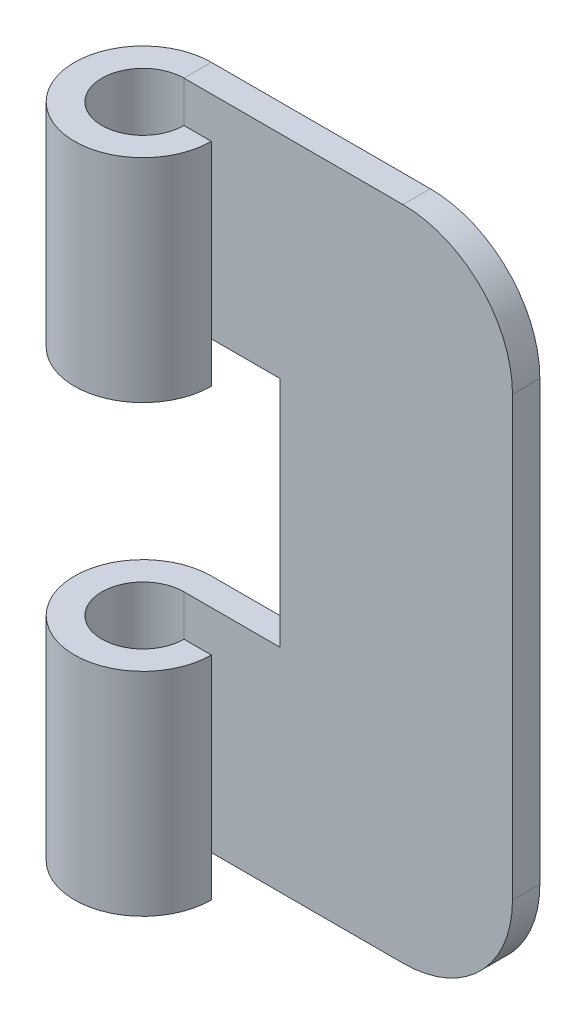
ISO-10303-21;
HEADER;
FILE_DESCRIPTION(('STEP AP214'),'2;1');
FILE_NAME('part.step','',(''),(''),'','','');
FILE_SCHEMA(('AUTOMOTIVE_DESIGN { 1 0 10303 214 1 1 1 1 }'));
ENDSEC;
DATA;
#1=APPLICATION_CONTEXT('core data for automotive mechanical design processes');
#2=APPLICATION_PROTOCOL_DEFINITION('international standard','automotive_design',2000,#1);
#3=PRODUCT_CONTEXT('',#1,'mechanical');
#4=PRODUCT('Part','Part','',(#3));
#5=PRODUCT_RELATED_PRODUCT_CATEGORY('part','',(#4));
#6=PRODUCT_DEFINITION_FORMATION('','',#4);
#7=PRODUCT_DEFINITION_CONTEXT('part definition',#1,'design');
#8=PRODUCT_DEFINITION('design','',#6,#7);
#9=PRODUCT_DEFINITION_SHAPE('','',#8);
#10=(LENGTH_UNIT() NAMED_UNIT(*) SI_UNIT(.MILLI.,.METRE.));
#11=(NAMED_UNIT(*) PLANE_ANGLE_UNIT() SI_UNIT($,.RADIAN.));
#12=(NAMED_UNIT(*) SI_UNIT($,.STERADIAN.) SOLID_ANGLE_UNIT());
#13=UNCERTAINTY_MEASURE_WITH_UNIT(LENGTH_MEASURE(1.E-05),#10,'distance_accuracy_value','');
#14=(GEOMETRIC_REPRESENTATION_CONTEXT(3) GLOBAL_UNCERTAINTY_ASSIGNED_CONTEXT((#13)) GLOBAL_UNIT_ASSIGNED_CONTEXT((#10,
#11,#12)) REPRESENTATION_CONTEXT('',''));
#15=CARTESIAN_POINT('',(0.,0.,0.));
#16=DIRECTION('',(0.,0.,1.));
#17=DIRECTION('',(1.,0.,0.));
#18=AXIS2_PLACEMENT_3D('',#15,#16,#17);
#19=CARTESIAN_POINT('',(0.,19.05,0.));
#20=DIRECTION('',(0.,-1.,0.));
#21=DIRECTION('',(0.,0.,-1.));
#22=AXIS2_PLACEMENT_3D('',#19,#20,#21);
#23=CYLINDRICAL_SURFACE('',#22,3.96875);
#24=CARTESIAN_POINT('',(0.,6.74687499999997,0.));
#25=DIRECTION('',(0.,1.,0.));
#26=DIRECTION('',(0.,0.,1.));
#27=AXIS2_PLACEMENT_3D('',#24,#25,#26);
#28=CIRCLE('',#27,3.96875);
#29=CARTESIAN_POINT('',(0.,6.74687499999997,-3.96875));
#30=VERTEX_POINT('',#29);
#31=CARTESIAN_POINT('',(3.96875,6.74687499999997,0.));
#32=VERTEX_POINT('',#31);
#33=EDGE_CURVE('E157',#30,#32,#28,.T.);
#34=ORIENTED_EDGE('',*,*,#33,.T.);
#35=DIRECTION('',(0.,-1.,0.));
#36=VECTOR('',#35,1.);
#37=CARTESIAN_POINT('',(3.96875,19.05,0.));
#38=LINE('',#37,#36);
#39=CARTESIAN_POINT('',(3.96875,19.05,0.));
#40=VERTEX_POINT('',#39);
#41=EDGE_CURVE('E226',#40,#32,#38,.T.);
#42=ORIENTED_EDGE('',*,*,#41,.F.);
#43=CARTESIAN_POINT('',(0.,19.05,0.));
#44=DIRECTION('',(0.,1.,0.));
#45=DIRECTION('',(1.,0.,0.));
#46=AXIS2_PLACEMENT_3D('',#43,#44,#45);
#47=CIRCLE('',#46,3.96875);
#48=CARTESIAN_POINT('',(0.,19.05,-3.96875));
#49=VERTEX_POINT('',#48);
#50=EDGE_CURVE('E185',#49,#40,#47,.T.);
#51=ORIENTED_EDGE('',*,*,#50,.F.);
#52=DIRECTION('',(0.,-1.,0.));
#53=VECTOR('',#52,1.);
#54=CARTESIAN_POINT('',(0.,19.05,-3.96875));
#55=LINE('',#54,#53);
#56=EDGE_CURVE('E210',#49,#30,#55,.T.);
#57=ORIENTED_EDGE('',*,*,#56,.T.);
#58=EDGE_LOOP('',(#34,#42,#51,#57));
#59=FACE_BOUND('',#58,.T.);
#60=ADVANCED_FACE('F37',(#59),#23,.T.);
#61=CARTESIAN_POINT('',(3.96875,-6.74687499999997,0.));
#62=VERTEX_POINT('',#61);
#63=CARTESIAN_POINT('',(3.96875,-19.05,0.));
#64=VERTEX_POINT('',#63);
#65=EDGE_CURVE('E225',#62,#64,#38,.T.);
#66=ORIENTED_EDGE('',*,*,#65,.F.);
#67=CARTESIAN_POINT('',(0.,-6.74687499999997,0.));
#68=DIRECTION('',(0.,-1.,0.));
#69=DIRECTION('',(0.,0.,-1.));
#70=AXIS2_PLACEMENT_3D('',#67,#68,#69);
#71=CIRCLE('',#70,3.96875);
#72=CARTESIAN_POINT('',(0.,-6.74687499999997,-3.96875));
#73=VERTEX_POINT('',#72);
#74=EDGE_CURVE('E174',#62,#73,#71,.T.);
#75=ORIENTED_EDGE('',*,*,#74,.T.);
#76=CARTESIAN_POINT('',(0.,-19.05,-3.96875));
#77=VERTEX_POINT('',#76);
#78=EDGE_CURVE('E198',#73,#77,#55,.T.);
#79=ORIENTED_EDGE('',*,*,#78,.T.);
#80=CARTESIAN_POINT('',(0.,-19.05,0.));
#81=DIRECTION('',(0.,1.,0.));
#82=DIRECTION('',(1.,0.,0.));
#83=AXIS2_PLACEMENT_3D('',#80,#81,#82);
#84=CIRCLE('',#83,3.96875);
#85=EDGE_CURVE('E184',#77,#64,#84,.T.);
#86=ORIENTED_EDGE('',*,*,#85,.T.);
#87=EDGE_LOOP('',(#66,#75,#79,#86));
#88=FACE_BOUND('',#87,.T.);
#89=ADVANCED_FACE('F296',(#88),#23,.T.);
#90=CARTESIAN_POINT('',(2.38125,19.05,0.));
#91=DIRECTION('',(0.,0.,-1.));
#92=DIRECTION('',(-1.,0.,0.));
#93=AXIS2_PLACEMENT_3D('',#90,#91,#92);
#94=PLANE('',#93);
#95=DIRECTION('',(1.,0.,0.));
#96=VECTOR('',#95,1.);
#97=CARTESIAN_POINT('',(2.38125,6.74687499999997,0.));
#98=LINE('',#97,#96);
#99=CARTESIAN_POINT('',(2.38125,6.74687499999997,0.));
#100=VERTEX_POINT('',#99);
#101=EDGE_CURVE('E181',#100,#32,#98,.T.);
#102=ORIENTED_EDGE('',*,*,#101,.F.);
#103=DIRECTION('',(0.,-1.,0.));
#104=VECTOR('',#103,1.);
#105=CARTESIAN_POINT('',(2.38125,19.05,0.));
#106=LINE('',#105,#104);
#107=CARTESIAN_POINT('',(2.38125,19.05,0.));
#108=VERTEX_POINT('',#107);
#109=EDGE_CURVE('E222',#108,#100,#106,.T.);
#110=ORIENTED_EDGE('',*,*,#109,.F.);
#111=DIRECTION('',(1.,0.,0.));
#112=VECTOR('',#111,1.);
#113=CARTESIAN_POINT('',(2.38125,19.05,0.));
#114=LINE('',#113,#112);
#115=EDGE_CURVE('E187',#108,#40,#114,.T.);
#116=ORIENTED_EDGE('',*,*,#115,.T.);
#117=ORIENTED_EDGE('',*,*,#41,.T.);
#118=EDGE_LOOP('',(#102,#110,#116,#117));
#119=FACE_BOUND('',#118,.T.);
#120=ADVANCED_FACE('F271',(#119),#94,.T.);
#121=CARTESIAN_POINT('',(0.,19.05,0.));
#122=DIRECTION('',(0.,-1.,0.));
#123=DIRECTION('',(0.,0.,-1.));
#124=AXIS2_PLACEMENT_3D('',#121,#122,#123);
#125=CYLINDRICAL_SURFACE('',#124,2.38125);
#126=CARTESIAN_POINT('',(0.,6.74687499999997,0.));
#127=DIRECTION('',(0.,1.,0.));
#128=DIRECTION('',(0.,0.,1.));
#129=AXIS2_PLACEMENT_3D('',#126,#127,#128);
#130=CIRCLE('',#129,2.38125);
#131=CARTESIAN_POINT('',(0.,6.74687499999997,-2.38125));
#132=VERTEX_POINT('',#131);
#133=EDGE_CURVE('E179',#132,#100,#130,.T.);
#134=ORIENTED_EDGE('',*,*,#133,.F.);
#135=DIRECTION('',(0.,-1.,0.));
#136=VECTOR('',#135,1.);
#137=CARTESIAN_POINT('',(0.,19.05,-2.38125));
#138=LINE('',#137,#136);
#139=CARTESIAN_POINT('',(0.,19.05,-2.38125));
#140=VERTEX_POINT('',#139);
#141=EDGE_CURVE('E218',#140,#132,#138,.T.);
#142=ORIENTED_EDGE('',*,*,#141,.F.);
#143=CARTESIAN_POINT('',(0.,19.05,0.));
#144=DIRECTION('',(0.,1.,0.));
#145=DIRECTION('',(0.,0.,1.));
#146=AXIS2_PLACEMENT_3D('',#143,#144,#145);
#147=CIRCLE('',#146,2.38125);
#148=EDGE_CURVE('E191',#140,#108,#147,.T.);
#149=ORIENTED_EDGE('',*,*,#148,.T.);
#150=ORIENTED_EDGE('',*,*,#109,.T.);
#151=EDGE_LOOP('',(#134,#142,#149,#150));
#152=FACE_BOUND('',#151,.T.);
#153=ADVANCED_FACE('F264',(#152),#125,.F.);
#154=CARTESIAN_POINT('',(0.,19.05,-3.96875));
#155=DIRECTION('',(0.,1.,0.));
#156=DIRECTION('',(0.,0.,1.));
#157=AXIS2_PLACEMENT_3D('',#154,#155,#156);
#158=PLANE('',#157);
#159=DIRECTION('',(0.,0.,1.));
#160=VECTOR('',#159,1.);
#161=CARTESIAN_POINT('',(0.,19.05,-3.96875));
#162=LINE('',#161,#160);
#163=EDGE_CURVE('E232',#49,#140,#162,.T.);
#164=ORIENTED_EDGE('',*,*,#163,.F.);
#165=ORIENTED_EDGE('',*,*,#50,.T.);
#166=ORIENTED_EDGE('',*,*,#115,.F.);
#167=ORIENTED_EDGE('',*,*,#148,.F.);
#168=EDGE_LOOP('',(#164,#165,#166,#167));
#169=FACE_BOUND('',#168,.T.);
#170=ADVANCED_FACE('F266',(#169),#158,.T.);
#171=CARTESIAN_POINT('',(0.,-19.05,-2.38125));
#172=DIRECTION('',(0.,-1.,0.));
#173=DIRECTION('',(0.,0.,-1.));
#174=AXIS2_PLACEMENT_3D('',#171,#172,#173);
#175=PLANE('',#174);
#176=DIRECTION('',(0.,0.,-1.));
#177=VECTOR('',#176,1.);
#178=CARTESIAN_POINT('',(0.,-19.05,-2.38125));
#179=LINE('',#178,#177);
#180=CARTESIAN_POINT('',(0.,-19.05,-2.38125));
#181=VERTEX_POINT('',#180);
#182=EDGE_CURVE('E229',#181,#77,#179,.T.);
#183=ORIENTED_EDGE('',*,*,#182,.F.);
#184=CARTESIAN_POINT('',(0.,-19.05,0.));
#185=DIRECTION('',(0.,1.,0.));
#186=DIRECTION('',(0.,0.,1.));
#187=AXIS2_PLACEMENT_3D('',#184,#185,#186);
#188=CIRCLE('',#187,2.38125);
#189=CARTESIAN_POINT('',(2.38125,-19.05,0.));
#190=VERTEX_POINT('',#189);
#191=EDGE_CURVE('E204',#181,#190,#188,.T.);
#192=ORIENTED_EDGE('',*,*,#191,.T.);
#193=DIRECTION('',(1.,0.,0.));
#194=VECTOR('',#193,1.);
#195=CARTESIAN_POINT('',(2.38125,-19.05,0.));
#196=LINE('',#195,#194);
#197=EDGE_CURVE('E201',#190,#64,#196,.T.);
#198=ORIENTED_EDGE('',*,*,#197,.T.);
#199=ORIENTED_EDGE('',*,*,#85,.F.);
#200=EDGE_LOOP('',(#183,#192,#198,#199));
#201=FACE_BOUND('',#200,.T.);
#202=ADVANCED_FACE('F285',(#201),#175,.T.);
#203=DIRECTION('',(-1.,0.,0.));
#204=VECTOR('',#203,1.);
#205=CARTESIAN_POINT('',(2.38125,-6.74687499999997,0.));
#206=LINE('',#205,#204);
#207=CARTESIAN_POINT('',(2.38125,-6.74687499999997,0.));
#208=VERTEX_POINT('',#207);
#209=EDGE_CURVE('E172',#62,#208,#206,.T.);
#210=ORIENTED_EDGE('',*,*,#209,.F.);
#211=ORIENTED_EDGE('',*,*,#65,.T.);
#212=ORIENTED_EDGE('',*,*,#197,.F.);
#213=EDGE_CURVE('E221',#208,#190,#106,.T.);
#214=ORIENTED_EDGE('',*,*,#213,.F.);
#215=EDGE_LOOP('',(#210,#211,#212,#214));
#216=FACE_BOUND('',#215,.T.);
#217=ADVANCED_FACE('F305',(#216),#94,.T.);
#218=CARTESIAN_POINT('',(0.,-6.74687499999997,0.));
#219=DIRECTION('',(0.,-1.,0.));
#220=DIRECTION('',(0.,0.,-1.));
#221=AXIS2_PLACEMENT_3D('',#218,#219,#220);
#222=CIRCLE('',#221,2.38125);
#223=CARTESIAN_POINT('',(0.,-6.74687499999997,-2.38125));
#224=VERTEX_POINT('',#223);
#225=EDGE_CURVE('E170',#208,#224,#222,.T.);
#226=ORIENTED_EDGE('',*,*,#225,.F.);
#227=ORIENTED_EDGE('',*,*,#213,.T.);
#228=ORIENTED_EDGE('',*,*,#191,.F.);
#229=EDGE_CURVE('E217',#224,#181,#138,.T.);
#230=ORIENTED_EDGE('',*,*,#229,.F.);
#231=EDGE_LOOP('',(#226,#227,#228,#230));
#232=FACE_BOUND('',#231,.T.);
#233=ADVANCED_FACE('F281',(#232),#125,.F.);
#234=CARTESIAN_POINT('',(19.05,19.05,-2.38125));
#235=DIRECTION('',(0.,0.,1.));
#236=DIRECTION('',(1.,0.,0.));
#237=AXIS2_PLACEMENT_3D('',#234,#235,#236);
#238=PLANE('',#237);
#239=DIRECTION('',(0.,-1.,0.));
#240=VECTOR('',#239,1.);
#241=CARTESIAN_POINT('',(19.05,19.05,-2.38125));
#242=LINE('',#241,#240);
#243=CARTESIAN_POINT('',(19.05,12.7,-2.38125));
#244=VERTEX_POINT('',#243);
#245=CARTESIAN_POINT('',(19.05,-12.7,-2.38125));
#246=VERTEX_POINT('',#245);
#247=EDGE_CURVE('E214',#244,#246,#242,.T.);
#248=ORIENTED_EDGE('',*,*,#247,.F.);
#249=CARTESIAN_POINT('',(12.7,12.7,-2.38125));
#250=DIRECTION('',(0.,0.,1.));
#251=DIRECTION('',(1.,0.,0.));
#252=AXIS2_PLACEMENT_3D('',#249,#250,#251);
#253=CIRCLE('',#252,6.35);
#254=CARTESIAN_POINT('',(12.7,19.05,-2.38125));
#255=VERTEX_POINT('',#254);
#256=EDGE_CURVE('E243',#244,#255,#253,.T.);
#257=ORIENTED_EDGE('',*,*,#256,.T.);
#258=DIRECTION('',(-1.,0.,0.));
#259=VECTOR('',#258,1.);
#260=CARTESIAN_POINT('',(19.05,19.05,-2.38125));
#261=LINE('',#260,#259);
#262=EDGE_CURVE('E194',#255,#140,#261,.T.);
#263=ORIENTED_EDGE('',*,*,#262,.T.);
#264=ORIENTED_EDGE('',*,*,#141,.T.);
#265=DIRECTION('',(-1.,0.,0.));
#266=VECTOR('',#265,1.);
#267=CARTESIAN_POINT('',(19.05,6.74687499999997,-2.38125));
#268=LINE('',#267,#266);
#269=CARTESIAN_POINT('',(5.55625,6.74687499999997,-2.38125));
#270=VERTEX_POINT('',#269);
#271=EDGE_CURVE('E177',#270,#132,#268,.T.);
#272=ORIENTED_EDGE('',*,*,#271,.F.);
#273=DIRECTION('',(0.,1.,0.));
#274=VECTOR('',#273,1.);
#275=CARTESIAN_POINT('',(5.55625,19.05,-2.38125));
#276=LINE('',#275,#274);
#277=CARTESIAN_POINT('',(5.55625,-6.74687499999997,-2.38125));
#278=VERTEX_POINT('',#277);
#279=EDGE_CURVE('E147',#278,#270,#276,.T.);
#280=ORIENTED_EDGE('',*,*,#279,.F.);
#281=DIRECTION('',(1.,0.,0.));
#282=VECTOR('',#281,1.);
#283=CARTESIAN_POINT('',(19.05,-6.74687499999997,-2.38125));
#284=LINE('',#283,#282);
#285=EDGE_CURVE('E150',#224,#278,#284,.T.);
#286=ORIENTED_EDGE('',*,*,#285,.F.);
#287=ORIENTED_EDGE('',*,*,#229,.T.);
#288=DIRECTION('',(-1.,0.,0.));
#289=VECTOR('',#288,1.);
#290=CARTESIAN_POINT('',(19.05,-19.05,-2.38125));
#291=LINE('',#290,#289);
#292=CARTESIAN_POINT('',(12.7,-19.05,-2.38125));
#293=VERTEX_POINT('',#292);
#294=EDGE_CURVE('E207',#293,#181,#291,.T.);
#295=ORIENTED_EDGE('',*,*,#294,.F.);
#296=CARTESIAN_POINT('',(12.7,-12.7,-2.38125));
#297=DIRECTION('',(0.,0.,1.));
#298=DIRECTION('',(1.,0.,0.));
#299=AXIS2_PLACEMENT_3D('',#296,#297,#298);
#300=CIRCLE('',#299,6.35);
#301=EDGE_CURVE('E241',#293,#246,#300,.T.);
#302=ORIENTED_EDGE('',*,*,#301,.T.);
#303=EDGE_LOOP('',(#248,#257,#263,#264,#272,#280,#286,#287,#295,#302));
#304=FACE_BOUND('',#303,.T.);
#305=ADVANCED_FACE('F256',(#304),#238,.T.);
#306=CARTESIAN_POINT('',(19.05,19.05,-3.96875));
#307=DIRECTION('',(1.,0.,0.));
#308=DIRECTION('',(0.,0.,-1.));
#309=AXIS2_PLACEMENT_3D('',#306,#307,#308);
#310=PLANE('',#309);
#311=DIRECTION('',(0.,-1.,0.));
#312=VECTOR('',#311,1.);
#313=CARTESIAN_POINT('',(19.05,19.05,-3.96875));
#314=LINE('',#313,#312);
#315=CARTESIAN_POINT('',(19.05,12.7,-3.96875));
#316=VERTEX_POINT('',#315);
#317=CARTESIAN_POINT('',(19.05,-12.7,-3.96875));
#318=VERTEX_POINT('',#317);
#319=EDGE_CURVE('E212',#316,#318,#314,.T.);
#320=ORIENTED_EDGE('',*,*,#319,.F.);
#321=DIRECTION('',(0.,0.,1.));
#322=VECTOR('',#321,1.);
#323=CARTESIAN_POINT('',(19.05,12.7,-3.96875));
#324=LINE('',#323,#322);
#325=EDGE_CURVE('E238',#316,#244,#324,.T.);
#326=ORIENTED_EDGE('',*,*,#325,.T.);
#327=ORIENTED_EDGE('',*,*,#247,.T.);
#328=DIRECTION('',(0.,0.,1.));
#329=VECTOR('',#328,1.);
#330=CARTESIAN_POINT('',(19.05,-12.7,-3.96875));
#331=LINE('',#330,#329);
#332=EDGE_CURVE('E236',#246,#318,#331,.F.);
#333=ORIENTED_EDGE('',*,*,#332,.T.);
#334=EDGE_LOOP('',(#320,#326,#327,#333));
#335=FACE_BOUND('',#334,.T.);
#336=ADVANCED_FACE('F251',(#335),#310,.T.);
#337=CARTESIAN_POINT('',(19.05,19.05,-3.96875));
#338=DIRECTION('',(0.,0.,1.));
#339=DIRECTION('',(1.,0.,0.));
#340=AXIS2_PLACEMENT_3D('',#337,#338,#339);
#341=PLANE('',#340);
#342=DIRECTION('',(-1.,0.,0.));
#343=VECTOR('',#342,1.);
#344=CARTESIAN_POINT('',(19.05,19.05,-3.96875));
#345=LINE('',#344,#343);
#346=CARTESIAN_POINT('',(12.7,19.05,-3.96875));
#347=VERTEX_POINT('',#346);
#348=EDGE_CURVE('E196',#347,#49,#345,.T.);
#349=ORIENTED_EDGE('',*,*,#348,.F.);
#350=CARTESIAN_POINT('',(12.7,12.7,-3.96875));
#351=DIRECTION('',(0.,0.,1.));
#352=DIRECTION('',(1.,0.,0.));
#353=AXIS2_PLACEMENT_3D('',#350,#351,#352);
#354=CIRCLE('',#353,6.35);
#355=EDGE_CURVE('E45',#347,#316,#354,.F.);
#356=ORIENTED_EDGE('',*,*,#355,.T.);
#357=ORIENTED_EDGE('',*,*,#319,.T.);
#358=CARTESIAN_POINT('',(12.7,-12.7,-3.96875));
#359=DIRECTION('',(0.,0.,1.));
#360=DIRECTION('',(1.,0.,0.));
#361=AXIS2_PLACEMENT_3D('',#358,#359,#360);
#362=CIRCLE('',#361,6.35);
#363=CARTESIAN_POINT('',(12.7,-19.05,-3.96875));
#364=VERTEX_POINT('',#363);
#365=EDGE_CURVE('E52',#318,#364,#362,.F.);
#366=ORIENTED_EDGE('',*,*,#365,.T.);
#367=DIRECTION('',(-1.,0.,0.));
#368=VECTOR('',#367,1.);
#369=CARTESIAN_POINT('',(19.05,-19.05,-3.96875));
#370=LINE('',#369,#368);
#371=EDGE_CURVE('E188',#364,#77,#370,.T.);
#372=ORIENTED_EDGE('',*,*,#371,.T.);
#373=ORIENTED_EDGE('',*,*,#78,.F.);
#374=DIRECTION('',(1.,0.,0.));
#375=VECTOR('',#374,1.);
#376=CARTESIAN_POINT('',(19.05,-6.74687499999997,-3.96875));
#377=LINE('',#376,#375);
#378=CARTESIAN_POINT('',(5.55625,-6.74687499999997,-3.96875));
#379=VERTEX_POINT('',#378);
#380=EDGE_CURVE('E165',#73,#379,#377,.T.);
#381=ORIENTED_EDGE('',*,*,#380,.T.);
#382=DIRECTION('',(0.,1.,0.));
#383=VECTOR('',#382,1.);
#384=CARTESIAN_POINT('',(5.55625,-6.74687499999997,-3.96875));
#385=LINE('',#384,#383);
#386=CARTESIAN_POINT('',(5.55625,6.74687499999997,-3.96875));
#387=VERTEX_POINT('',#386);
#388=EDGE_CURVE('E144',#379,#387,#385,.T.);
#389=ORIENTED_EDGE('',*,*,#388,.T.);
#390=DIRECTION('',(-1.,0.,0.));
#391=VECTOR('',#390,1.);
#392=CARTESIAN_POINT('',(-3.96875,6.74687499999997,-3.96875));
#393=LINE('',#392,#391);
#394=EDGE_CURVE('E154',#387,#30,#393,.T.);
#395=ORIENTED_EDGE('',*,*,#394,.T.);
#396=ORIENTED_EDGE('',*,*,#56,.F.);
#397=EDGE_LOOP('',(#349,#356,#357,#366,#372,#373,#381,#389,#395,#396));
#398=FACE_BOUND('',#397,.T.);
#399=ADVANCED_FACE('F162',(#398),#341,.F.);
#400=CARTESIAN_POINT('',(0.,19.05,0.));
#401=DIRECTION('',(0.,1.,0.));
#402=DIRECTION('',(0.,0.,1.));
#403=AXIS2_PLACEMENT_3D('',#400,#401,#402);
#404=PLANE('',#403);
#405=ORIENTED_EDGE('',*,*,#262,.F.);
#406=DIRECTION('',(0.,0.,1.));
#407=VECTOR('',#406,1.);
#408=CARTESIAN_POINT('',(12.7,19.05,0.));
#409=LINE('',#408,#407);
#410=EDGE_CURVE('E60',#255,#347,#409,.F.);
#411=ORIENTED_EDGE('',*,*,#410,.T.);
#412=ORIENTED_EDGE('',*,*,#348,.T.);
#413=ORIENTED_EDGE('',*,*,#163,.T.);
#414=EDGE_LOOP('',(#405,#411,#412,#413));
#415=FACE_BOUND('',#414,.T.);
#416=ADVANCED_FACE('F257',(#415),#404,.T.);
#417=CARTESIAN_POINT('',(0.,-19.05,0.));
#418=DIRECTION('',(0.,1.,0.));
#419=DIRECTION('',(0.,0.,1.));
#420=AXIS2_PLACEMENT_3D('',#417,#418,#419);
#421=PLANE('',#420);
#422=ORIENTED_EDGE('',*,*,#371,.F.);
#423=DIRECTION('',(0.,0.,1.));
#424=VECTOR('',#423,1.);
#425=CARTESIAN_POINT('',(12.7,-19.05,-2.38125));
#426=LINE('',#425,#424);
#427=EDGE_CURVE('E11',#364,#293,#426,.T.);
#428=ORIENTED_EDGE('',*,*,#427,.T.);
#429=ORIENTED_EDGE('',*,*,#294,.T.);
#430=ORIENTED_EDGE('',*,*,#182,.T.);
#431=EDGE_LOOP('',(#422,#428,#429,#430));
#432=FACE_BOUND('',#431,.T.);
#433=ADVANCED_FACE('F288',(#432),#421,.F.);
#434=CARTESIAN_POINT('',(-3.96875,6.74687499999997,-3.96875));
#435=DIRECTION('',(0.,1.,0.));
#436=DIRECTION('',(0.,0.,1.));
#437=AXIS2_PLACEMENT_3D('',#434,#435,#436);
#438=PLANE('',#437);
#439=ORIENTED_EDGE('',*,*,#394,.F.);
#440=DIRECTION('',(0.,0.,1.));
#441=VECTOR('',#440,1.);
#442=CARTESIAN_POINT('',(5.55625,6.74687499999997,-3.96875));
#443=LINE('',#442,#441);
#444=EDGE_CURVE('E139',#387,#270,#443,.T.);
#445=ORIENTED_EDGE('',*,*,#444,.T.);
#446=ORIENTED_EDGE('',*,*,#271,.T.);
#447=ORIENTED_EDGE('',*,*,#133,.T.);
#448=ORIENTED_EDGE('',*,*,#101,.T.);
#449=ORIENTED_EDGE('',*,*,#33,.F.);
#450=EDGE_LOOP('',(#439,#445,#446,#447,#448,#449));
#451=FACE_BOUND('',#450,.T.);
#452=ADVANCED_FACE('F155',(#451),#438,.F.);
#453=CARTESIAN_POINT('',(-3.96875,-6.74687499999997,-3.96875));
#454=DIRECTION('',(0.,-1.,0.));
#455=DIRECTION('',(0.,0.,-1.));
#456=AXIS2_PLACEMENT_3D('',#453,#454,#455);
#457=PLANE('',#456);
#458=ORIENTED_EDGE('',*,*,#74,.F.);
#459=ORIENTED_EDGE('',*,*,#209,.T.);
#460=ORIENTED_EDGE('',*,*,#225,.T.);
#461=ORIENTED_EDGE('',*,*,#285,.T.);
#462=DIRECTION('',(0.,0.,1.));
#463=VECTOR('',#462,1.);
#464=CARTESIAN_POINT('',(5.55625,-6.74687499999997,-3.96875));
#465=LINE('',#464,#463);
#466=EDGE_CURVE('E151',#379,#278,#465,.T.);
#467=ORIENTED_EDGE('',*,*,#466,.F.);
#468=ORIENTED_EDGE('',*,*,#380,.F.);
#469=EDGE_LOOP('',(#458,#459,#460,#461,#467,#468));
#470=FACE_BOUND('',#469,.T.);
#471=ADVANCED_FACE('F328',(#470),#457,.F.);
#472=CARTESIAN_POINT('',(5.55625,-6.74687499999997,-3.96875));
#473=DIRECTION('',(1.,0.,0.));
#474=DIRECTION('',(0.,0.,-1.));
#475=AXIS2_PLACEMENT_3D('',#472,#473,#474);
#476=PLANE('',#475);
#477=ORIENTED_EDGE('',*,*,#279,.T.);
#478=ORIENTED_EDGE('',*,*,#444,.F.);
#479=ORIENTED_EDGE('',*,*,#388,.F.);
#480=ORIENTED_EDGE('',*,*,#466,.T.);
#481=EDGE_LOOP('',(#477,#478,#479,#480));
#482=FACE_BOUND('',#481,.T.);
#483=ADVANCED_FACE('F141',(#482),#476,.F.);
#484=CARTESIAN_POINT('',(12.7,12.7,-3.96875));
#485=DIRECTION('',(0.,0.,1.));
#486=DIRECTION('',(1.,0.,0.));
#487=AXIS2_PLACEMENT_3D('',#484,#485,#486);
#488=CYLINDRICAL_SURFACE('',#487,6.35);
#489=ORIENTED_EDGE('',*,*,#355,.F.);
#490=ORIENTED_EDGE('',*,*,#410,.F.);
#491=ORIENTED_EDGE('',*,*,#256,.F.);
#492=ORIENTED_EDGE('',*,*,#325,.F.);
#493=EDGE_LOOP('',(#489,#490,#491,#492));
#494=FACE_BOUND('',#493,.T.);
#495=ADVANCED_FACE('F254',(#494),#488,.T.);
#496=CARTESIAN_POINT('',(12.7,-12.7,0.));
#497=DIRECTION('',(0.,0.,-1.));
#498=DIRECTION('',(-1.,0.,0.));
#499=AXIS2_PLACEMENT_3D('',#496,#497,#498);
#500=CYLINDRICAL_SURFACE('',#499,6.35);
#501=ORIENTED_EDGE('',*,*,#365,.F.);
#502=ORIENTED_EDGE('',*,*,#332,.F.);
#503=ORIENTED_EDGE('',*,*,#301,.F.);
#504=ORIENTED_EDGE('',*,*,#427,.F.);
#505=EDGE_LOOP('',(#501,#502,#503,#504));
#506=FACE_BOUND('',#505,.T.);
#507=ADVANCED_FACE('F39',(#506),#500,.T.);
#508=CLOSED_SHELL('',(#60,#89,#120,#153,#170,#202,#217,#233,#305,#336,#399,#416,#433,#452,#471,
#483,#495,#507));
#509=MANIFOLD_SOLID_BREP('B2',#508);
#510=ADVANCED_BREP_SHAPE_REPRESENTATION('',(#18,#509),#14);
#511=SHAPE_DEFINITION_REPRESENTATION(#9,#510);
ENDSEC;
END-ISO-10303-21;
